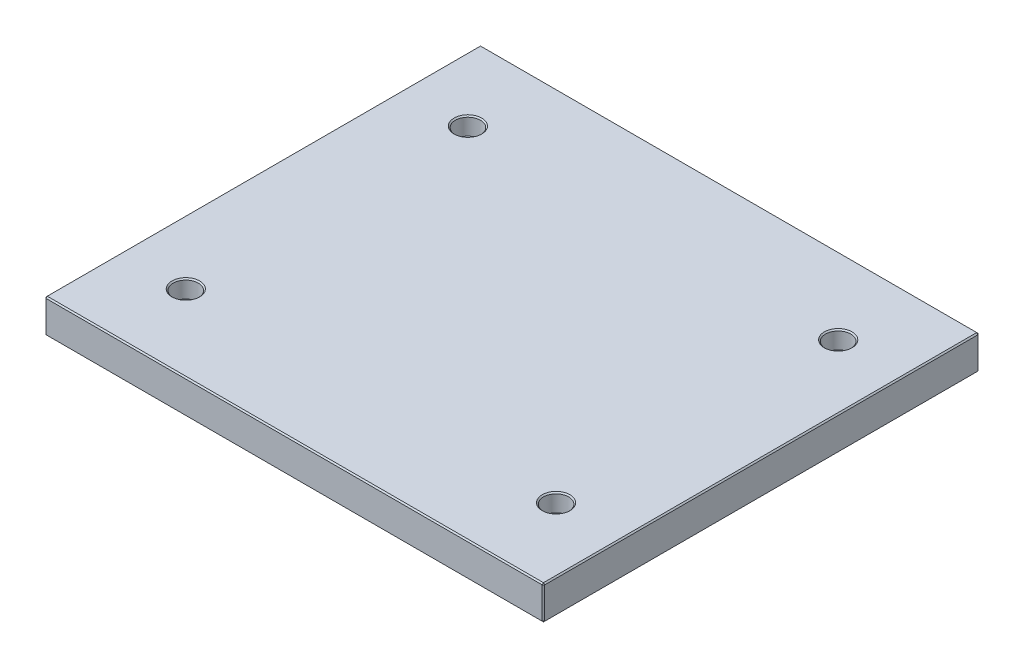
ISO-10303-21;
HEADER;
FILE_DESCRIPTION(('STEP AP214'),'2;1');
FILE_NAME('part.step','',(''),(''),'','','');
FILE_SCHEMA(('AUTOMOTIVE_DESIGN { 1 0 10303 214 1 1 1 1 }'));
ENDSEC;
DATA;
#1=APPLICATION_CONTEXT('core data for automotive mechanical design processes');
#2=APPLICATION_PROTOCOL_DEFINITION('international standard','automotive_design',2000,#1);
#3=PRODUCT_CONTEXT('',#1,'mechanical');
#4=PRODUCT('Part','Part','',(#3));
#5=PRODUCT_RELATED_PRODUCT_CATEGORY('part','',(#4));
#6=PRODUCT_DEFINITION_FORMATION('','',#4);
#7=PRODUCT_DEFINITION_CONTEXT('part definition',#1,'design');
#8=PRODUCT_DEFINITION('design','',#6,#7);
#9=PRODUCT_DEFINITION_SHAPE('','',#8);
#10=(LENGTH_UNIT() NAMED_UNIT(*) SI_UNIT(.MILLI.,.METRE.));
#11=(NAMED_UNIT(*) PLANE_ANGLE_UNIT() SI_UNIT($,.RADIAN.));
#12=(NAMED_UNIT(*) SI_UNIT($,.STERADIAN.) SOLID_ANGLE_UNIT());
#13=UNCERTAINTY_MEASURE_WITH_UNIT(LENGTH_MEASURE(1.E-05),#10,'distance_accuracy_value','');
#14=(GEOMETRIC_REPRESENTATION_CONTEXT(3) GLOBAL_UNCERTAINTY_ASSIGNED_CONTEXT((#13)) GLOBAL_UNIT_ASSIGNED_CONTEXT((#10,
#11,#12)) REPRESENTATION_CONTEXT('',''));
#15=CARTESIAN_POINT('',(0.,0.,0.));
#16=DIRECTION('',(0.,0.,1.));
#17=DIRECTION('',(1.,0.,0.));
#18=AXIS2_PLACEMENT_3D('',#15,#16,#17);
#19=CARTESIAN_POINT('',(-198.,27.,173.));
#20=DIRECTION('',(1.,0.,0.));
#21=DIRECTION('',(0.,0.,-1.));
#22=AXIS2_PLACEMENT_3D('',#19,#20,#21);
#23=PLANE('',#22);
#24=DIRECTION('',(0.,-1.,0.));
#25=VECTOR('',#24,1.);
#26=CARTESIAN_POINT('',(-198.,27.,-172.));
#27=LINE('',#26,#25);
#28=CARTESIAN_POINT('',(-198.,26.,-172.));
#29=VERTEX_POINT('',#28);
#30=CARTESIAN_POINT('',(-198.,1.,-172.));
#31=VERTEX_POINT('',#30);
#32=EDGE_CURVE('E115',#29,#31,#27,.T.);
#33=ORIENTED_EDGE('',*,*,#32,.T.);
#34=DIRECTION('',(0.,0.,1.));
#35=VECTOR('',#34,1.);
#36=CARTESIAN_POINT('',(-198.,1.,173.));
#37=LINE('',#36,#35);
#38=CARTESIAN_POINT('',(-198.,1.,172.));
#39=VERTEX_POINT('',#38);
#40=EDGE_CURVE('E111',#31,#39,#37,.T.);
#41=ORIENTED_EDGE('',*,*,#40,.T.);
#42=DIRECTION('',(0.,1.,0.));
#43=VECTOR('',#42,1.);
#44=CARTESIAN_POINT('',(-198.,27.,172.));
#45=LINE('',#44,#43);
#46=CARTESIAN_POINT('',(-198.,26.,172.));
#47=VERTEX_POINT('',#46);
#48=EDGE_CURVE('E104',#39,#47,#45,.T.);
#49=ORIENTED_EDGE('',*,*,#48,.T.);
#50=DIRECTION('',(0.,0.,-1.));
#51=VECTOR('',#50,1.);
#52=CARTESIAN_POINT('',(-198.,26.,-173.));
#53=LINE('',#52,#51);
#54=EDGE_CURVE('E108',#47,#29,#53,.T.);
#55=ORIENTED_EDGE('',*,*,#54,.T.);
#56=EDGE_LOOP('',(#33,#41,#49,#55));
#57=FACE_BOUND('',#56,.T.);
#58=ADVANCED_FACE('F16',(#57),#23,.F.);
#59=CARTESIAN_POINT('',(198.,27.,173.));
#60=DIRECTION('',(0.,0.,-1.));
#61=DIRECTION('',(-1.,0.,0.));
#62=AXIS2_PLACEMENT_3D('',#59,#60,#61);
#63=PLANE('',#62);
#64=DIRECTION('',(-1.,0.,0.));
#65=VECTOR('',#64,1.);
#66=CARTESIAN_POINT('',(-198.,26.,173.));
#67=LINE('',#66,#65);
#68=CARTESIAN_POINT('',(197.,26.,173.));
#69=VERTEX_POINT('',#68);
#70=CARTESIAN_POINT('',(-197.,26.,173.));
#71=VERTEX_POINT('',#70);
#72=EDGE_CURVE('E170',#69,#71,#67,.T.);
#73=ORIENTED_EDGE('',*,*,#72,.T.);
#74=DIRECTION('',(0.,-1.,0.));
#75=VECTOR('',#74,1.);
#76=CARTESIAN_POINT('',(-197.,27.,173.));
#77=LINE('',#76,#75);
#78=CARTESIAN_POINT('',(-197.,1.,173.));
#79=VERTEX_POINT('',#78);
#80=EDGE_CURVE('E123',#71,#79,#77,.T.);
#81=ORIENTED_EDGE('',*,*,#80,.T.);
#82=DIRECTION('',(1.,0.,0.));
#83=VECTOR('',#82,1.);
#84=CARTESIAN_POINT('',(198.,1.,173.));
#85=LINE('',#84,#83);
#86=CARTESIAN_POINT('',(197.,1.,173.));
#87=VERTEX_POINT('',#86);
#88=EDGE_CURVE('E174',#79,#87,#85,.T.);
#89=ORIENTED_EDGE('',*,*,#88,.T.);
#90=DIRECTION('',(0.,1.,0.));
#91=VECTOR('',#90,1.);
#92=CARTESIAN_POINT('',(197.,27.,173.));
#93=LINE('',#92,#91);
#94=EDGE_CURVE('E172',#87,#69,#93,.T.);
#95=ORIENTED_EDGE('',*,*,#94,.T.);
#96=EDGE_LOOP('',(#73,#81,#89,#95));
#97=FACE_BOUND('',#96,.T.);
#98=ADVANCED_FACE('F317',(#97),#63,.F.);
#99=CARTESIAN_POINT('',(198.,27.,173.));
#100=DIRECTION('',(-1.,0.,0.));
#101=DIRECTION('',(0.,0.,1.));
#102=AXIS2_PLACEMENT_3D('',#99,#100,#101);
#103=PLANE('',#102);
#104=DIRECTION('',(0.,0.,-1.));
#105=VECTOR('',#104,1.);
#106=CARTESIAN_POINT('',(198.,1.,173.));
#107=LINE('',#106,#105);
#108=CARTESIAN_POINT('',(198.,1.,172.));
#109=VERTEX_POINT('',#108);
#110=CARTESIAN_POINT('',(198.,1.,-172.));
#111=VERTEX_POINT('',#110);
#112=EDGE_CURVE('E165',#109,#111,#107,.T.);
#113=ORIENTED_EDGE('',*,*,#112,.T.);
#114=DIRECTION('',(0.,1.,0.));
#115=VECTOR('',#114,1.);
#116=CARTESIAN_POINT('',(198.,27.,-172.));
#117=LINE('',#116,#115);
#118=CARTESIAN_POINT('',(198.,26.,-172.));
#119=VERTEX_POINT('',#118);
#120=EDGE_CURVE('E167',#111,#119,#117,.T.);
#121=ORIENTED_EDGE('',*,*,#120,.T.);
#122=DIRECTION('',(0.,0.,1.));
#123=VECTOR('',#122,1.);
#124=CARTESIAN_POINT('',(198.,26.,173.));
#125=LINE('',#124,#123);
#126=CARTESIAN_POINT('',(198.,26.,172.));
#127=VERTEX_POINT('',#126);
#128=EDGE_CURVE('E161',#119,#127,#125,.T.);
#129=ORIENTED_EDGE('',*,*,#128,.T.);
#130=DIRECTION('',(0.,-1.,0.));
#131=VECTOR('',#130,1.);
#132=CARTESIAN_POINT('',(198.,27.,172.));
#133=LINE('',#132,#131);
#134=EDGE_CURVE('E163',#127,#109,#133,.T.);
#135=ORIENTED_EDGE('',*,*,#134,.T.);
#136=EDGE_LOOP('',(#113,#121,#129,#135));
#137=FACE_BOUND('',#136,.T.);
#138=ADVANCED_FACE('F323',(#137),#103,.F.);
#139=CARTESIAN_POINT('',(198.,27.,-173.));
#140=DIRECTION('',(0.,0.,1.));
#141=DIRECTION('',(1.,0.,0.));
#142=AXIS2_PLACEMENT_3D('',#139,#140,#141);
#143=PLANE('',#142);
#144=DIRECTION('',(0.,-1.,0.));
#145=VECTOR('',#144,1.);
#146=CARTESIAN_POINT('',(197.,27.,-173.));
#147=LINE('',#146,#145);
#148=CARTESIAN_POINT('',(197.,26.,-173.));
#149=VERTEX_POINT('',#148);
#150=CARTESIAN_POINT('',(197.,1.,-173.));
#151=VERTEX_POINT('',#150);
#152=EDGE_CURVE('E154',#149,#151,#147,.T.);
#153=ORIENTED_EDGE('',*,*,#152,.T.);
#154=DIRECTION('',(-1.,0.,0.));
#155=VECTOR('',#154,1.);
#156=CARTESIAN_POINT('',(198.,1.,-173.));
#157=LINE('',#156,#155);
#158=CARTESIAN_POINT('',(-197.,1.,-173.));
#159=VERTEX_POINT('',#158);
#160=EDGE_CURVE('E159',#151,#159,#157,.T.);
#161=ORIENTED_EDGE('',*,*,#160,.T.);
#162=DIRECTION('',(0.,1.,0.));
#163=VECTOR('',#162,1.);
#164=CARTESIAN_POINT('',(-197.,27.,-173.));
#165=LINE('',#164,#163);
#166=CARTESIAN_POINT('',(-197.,26.,-173.));
#167=VERTEX_POINT('',#166);
#168=EDGE_CURVE('E156',#159,#167,#165,.T.);
#169=ORIENTED_EDGE('',*,*,#168,.T.);
#170=DIRECTION('',(1.,0.,0.));
#171=VECTOR('',#170,1.);
#172=CARTESIAN_POINT('',(198.,26.,-173.));
#173=LINE('',#172,#171);
#174=EDGE_CURVE('E152',#167,#149,#173,.T.);
#175=ORIENTED_EDGE('',*,*,#174,.T.);
#176=EDGE_LOOP('',(#153,#161,#169,#175));
#177=FACE_BOUND('',#176,.T.);
#178=ADVANCED_FACE('F465',(#177),#143,.F.);
#179=CARTESIAN_POINT('',(0.,27.,0.));
#180=DIRECTION('',(0.,1.,0.));
#181=DIRECTION('',(0.,0.,1.));
#182=AXIS2_PLACEMENT_3D('',#179,#180,#181);
#183=PLANE('',#182);
#184=CARTESIAN_POINT('',(-147.,27.,112.));
#185=DIRECTION('',(0.,1.,0.));
#186=DIRECTION('',(0.,0.,1.));
#187=AXIS2_PLACEMENT_3D('',#184,#185,#186);
#188=CIRCLE('',#187,11.0000000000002);
#189=CARTESIAN_POINT('',(-147.,27.,123.));
#190=VERTEX_POINT('',#189);
#191=EDGE_CURVE('E290',#190,#190,#188,.F.);
#192=ORIENTED_EDGE('',*,*,#191,.T.);
#193=EDGE_LOOP('',(#192));
#194=FACE_BOUND('',#193,.T.);
#195=CARTESIAN_POINT('',(147.,27.,112.));
#196=DIRECTION('',(0.,1.,0.));
#197=DIRECTION('',(0.,0.,1.));
#198=AXIS2_PLACEMENT_3D('',#195,#196,#197);
#199=CIRCLE('',#198,11.0000000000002);
#200=CARTESIAN_POINT('',(147.,27.,123.));
#201=VERTEX_POINT('',#200);
#202=EDGE_CURVE('E287',#201,#201,#199,.F.);
#203=ORIENTED_EDGE('',*,*,#202,.T.);
#204=EDGE_LOOP('',(#203));
#205=FACE_BOUND('',#204,.T.);
#206=CARTESIAN_POINT('',(147.,27.,-112.));
#207=DIRECTION('',(0.,1.,0.));
#208=DIRECTION('',(0.,0.,1.));
#209=AXIS2_PLACEMENT_3D('',#206,#207,#208);
#210=CIRCLE('',#209,11.0000000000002);
#211=CARTESIAN_POINT('',(147.,27.,-101.));
#212=VERTEX_POINT('',#211);
#213=EDGE_CURVE('E284',#212,#212,#210,.F.);
#214=ORIENTED_EDGE('',*,*,#213,.T.);
#215=EDGE_LOOP('',(#214));
#216=FACE_BOUND('',#215,.T.);
#217=CARTESIAN_POINT('',(-147.,27.,-112.));
#218=DIRECTION('',(0.,1.,0.));
#219=DIRECTION('',(0.,0.,1.));
#220=AXIS2_PLACEMENT_3D('',#217,#218,#219);
#221=CIRCLE('',#220,11.0000000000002);
#222=CARTESIAN_POINT('',(-147.,27.,-101.));
#223=VERTEX_POINT('',#222);
#224=EDGE_CURVE('E281',#223,#223,#221,.F.);
#225=ORIENTED_EDGE('',*,*,#224,.T.);
#226=EDGE_LOOP('',(#225));
#227=FACE_BOUND('',#226,.T.);
#228=DIRECTION('',(0.,0.,-1.));
#229=VECTOR('',#228,1.);
#230=CARTESIAN_POINT('',(197.,27.,-173.));
#231=LINE('',#230,#229);
#232=CARTESIAN_POINT('',(197.,27.,172.));
#233=VERTEX_POINT('',#232);
#234=CARTESIAN_POINT('',(197.,27.,-172.));
#235=VERTEX_POINT('',#234);
#236=EDGE_CURVE('E31',#233,#235,#231,.T.);
#237=ORIENTED_EDGE('',*,*,#236,.T.);
#238=DIRECTION('',(-1.,0.,0.));
#239=VECTOR('',#238,1.);
#240=CARTESIAN_POINT('',(-198.,27.,-172.));
#241=LINE('',#240,#239);
#242=CARTESIAN_POINT('',(-197.,27.,-172.));
#243=VERTEX_POINT('',#242);
#244=EDGE_CURVE('E190',#235,#243,#241,.T.);
#245=ORIENTED_EDGE('',*,*,#244,.T.);
#246=DIRECTION('',(0.,0.,1.));
#247=VECTOR('',#246,1.);
#248=CARTESIAN_POINT('',(-197.,27.,173.));
#249=LINE('',#248,#247);
#250=CARTESIAN_POINT('',(-197.,27.,172.));
#251=VERTEX_POINT('',#250);
#252=EDGE_CURVE('E186',#243,#251,#249,.T.);
#253=ORIENTED_EDGE('',*,*,#252,.T.);
#254=DIRECTION('',(1.,0.,0.));
#255=VECTOR('',#254,1.);
#256=CARTESIAN_POINT('',(198.,27.,172.));
#257=LINE('',#256,#255);
#258=EDGE_CURVE('E36',#251,#233,#257,.T.);
#259=ORIENTED_EDGE('',*,*,#258,.T.);
#260=EDGE_LOOP('',(#237,#245,#253,#259));
#261=FACE_BOUND('',#260,.T.);
#262=ADVANCED_FACE('F462',(#194,#205,#216,#227,#261),#183,.T.);
#263=CARTESIAN_POINT('',(0.,0.,0.));
#264=DIRECTION('',(0.,1.,0.));
#265=DIRECTION('',(0.,0.,1.));
#266=AXIS2_PLACEMENT_3D('',#263,#264,#265);
#267=PLANE('',#266);
#268=CARTESIAN_POINT('',(147.,0.,-112.));
#269=DIRECTION('',(0.,1.,0.));
#270=DIRECTION('',(0.,0.,1.));
#271=AXIS2_PLACEMENT_3D('',#268,#269,#270);
#272=CIRCLE('',#271,8.00000000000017);
#273=CARTESIAN_POINT('',(147.,0.,-104.));
#274=VERTEX_POINT('',#273);
#275=EDGE_CURVE('E263',#274,#274,#272,.T.);
#276=ORIENTED_EDGE('',*,*,#275,.T.);
#277=EDGE_LOOP('',(#276));
#278=FACE_BOUND('',#277,.T.);
#279=CARTESIAN_POINT('',(147.,0.,112.));
#280=DIRECTION('',(0.,1.,0.));
#281=DIRECTION('',(0.,0.,1.));
#282=AXIS2_PLACEMENT_3D('',#279,#280,#281);
#283=CIRCLE('',#282,8.00000000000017);
#284=CARTESIAN_POINT('',(147.,0.,120.));
#285=VERTEX_POINT('',#284);
#286=EDGE_CURVE('E260',#285,#285,#283,.T.);
#287=ORIENTED_EDGE('',*,*,#286,.T.);
#288=EDGE_LOOP('',(#287));
#289=FACE_BOUND('',#288,.T.);
#290=CARTESIAN_POINT('',(-147.,0.,112.));
#291=DIRECTION('',(0.,1.,0.));
#292=DIRECTION('',(0.,0.,1.));
#293=AXIS2_PLACEMENT_3D('',#290,#291,#292);
#294=CIRCLE('',#293,8.);
#295=CARTESIAN_POINT('',(-147.,0.,120.));
#296=VERTEX_POINT('',#295);
#297=EDGE_CURVE('E257',#296,#296,#294,.T.);
#298=ORIENTED_EDGE('',*,*,#297,.T.);
#299=EDGE_LOOP('',(#298));
#300=FACE_BOUND('',#299,.T.);
#301=CARTESIAN_POINT('',(-147.,0.,-112.));
#302=DIRECTION('',(0.,1.,0.));
#303=DIRECTION('',(0.,0.,1.));
#304=AXIS2_PLACEMENT_3D('',#301,#302,#303);
#305=CIRCLE('',#304,8.);
#306=CARTESIAN_POINT('',(-147.,0.,-104.));
#307=VERTEX_POINT('',#306);
#308=EDGE_CURVE('E192',#307,#307,#305,.T.);
#309=ORIENTED_EDGE('',*,*,#308,.T.);
#310=EDGE_LOOP('',(#309));
#311=FACE_BOUND('',#310,.T.);
#312=DIRECTION('',(0.,0.,1.));
#313=VECTOR('',#312,1.);
#314=CARTESIAN_POINT('',(197.,0.,0.));
#315=LINE('',#314,#313);
#316=CARTESIAN_POINT('',(197.,0.,-172.));
#317=VERTEX_POINT('',#316);
#318=CARTESIAN_POINT('',(197.,0.,172.));
#319=VERTEX_POINT('',#318);
#320=EDGE_CURVE('E177',#317,#319,#315,.T.);
#321=ORIENTED_EDGE('',*,*,#320,.T.);
#322=DIRECTION('',(-1.,0.,0.));
#323=VECTOR('',#322,1.);
#324=CARTESIAN_POINT('',(0.,0.,172.));
#325=LINE('',#324,#323);
#326=CARTESIAN_POINT('',(-197.,0.,172.));
#327=VERTEX_POINT('',#326);
#328=EDGE_CURVE('E183',#319,#327,#325,.T.);
#329=ORIENTED_EDGE('',*,*,#328,.T.);
#330=DIRECTION('',(0.,0.,-1.));
#331=VECTOR('',#330,1.);
#332=CARTESIAN_POINT('',(-197.,0.,0.));
#333=LINE('',#332,#331);
#334=CARTESIAN_POINT('',(-197.,0.,-172.));
#335=VERTEX_POINT('',#334);
#336=EDGE_CURVE('E181',#327,#335,#333,.T.);
#337=ORIENTED_EDGE('',*,*,#336,.T.);
#338=DIRECTION('',(1.,0.,0.));
#339=VECTOR('',#338,1.);
#340=CARTESIAN_POINT('',(0.,0.,-172.));
#341=LINE('',#340,#339);
#342=EDGE_CURVE('E179',#335,#317,#341,.T.);
#343=ORIENTED_EDGE('',*,*,#342,.T.);
#344=EDGE_LOOP('',(#321,#329,#337,#343));
#345=FACE_BOUND('',#344,.T.);
#346=ADVANCED_FACE('F402',(#278,#289,#300,#311,#345),#267,.F.);
#347=CARTESIAN_POINT('',(198.,27.,172.));
#348=DIRECTION('',(-0.707106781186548,0.,-0.707106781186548));
#349=DIRECTION('',(0.,-1.,0.));
#350=AXIS2_PLACEMENT_3D('',#347,#348,#349);
#351=PLANE('',#350);
#352=DIRECTION('',(-0.707106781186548,0.,0.707106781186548));
#353=VECTOR('',#352,1.);
#354=CARTESIAN_POINT('',(197.,26.,173.));
#355=LINE('',#354,#353);
#356=EDGE_CURVE('E141',#69,#127,#355,.F.);
#357=ORIENTED_EDGE('',*,*,#356,.F.);
#358=ORIENTED_EDGE('',*,*,#94,.F.);
#359=DIRECTION('',(0.707106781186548,0.,-0.707106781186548));
#360=VECTOR('',#359,1.);
#361=CARTESIAN_POINT('',(197.,1.,173.));
#362=LINE('',#361,#360);
#363=EDGE_CURVE('E144',#109,#87,#362,.F.);
#364=ORIENTED_EDGE('',*,*,#363,.F.);
#365=ORIENTED_EDGE('',*,*,#134,.F.);
#366=EDGE_LOOP('',(#357,#358,#364,#365));
#367=FACE_BOUND('',#366,.T.);
#368=ADVANCED_FACE('F398',(#367),#351,.F.);
#369=CARTESIAN_POINT('',(197.,26.,173.));
#370=DIRECTION('',(0.577350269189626,0.577350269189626,0.577350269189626));
#371=DIRECTION('',(0.707106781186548,0.,-0.707106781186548));
#372=AXIS2_PLACEMENT_3D('',#369,#370,#371);
#373=PLANE('',#372);
#374=DIRECTION('',(0.,-0.707106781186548,0.707106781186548));
#375=VECTOR('',#374,1.);
#376=CARTESIAN_POINT('',(197.,26.,173.));
#377=LINE('',#376,#375);
#378=EDGE_CURVE('E235',#69,#233,#377,.F.);
#379=ORIENTED_EDGE('',*,*,#378,.F.);
#380=ORIENTED_EDGE('',*,*,#356,.T.);
#381=DIRECTION('',(-0.707106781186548,0.707106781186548,0.));
#382=VECTOR('',#381,1.);
#383=CARTESIAN_POINT('',(197.5,26.5,172.));
#384=LINE('',#383,#382);
#385=EDGE_CURVE('E237',#233,#127,#384,.F.);
#386=ORIENTED_EDGE('',*,*,#385,.F.);
#387=EDGE_LOOP('',(#379,#380,#386));
#388=FACE_BOUND('',#387,.T.);
#389=ADVANCED_FACE('F394',(#388),#373,.T.);
#390=CARTESIAN_POINT('',(197.,1.,173.));
#391=DIRECTION('',(0.577350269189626,-0.577350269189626,0.577350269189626));
#392=DIRECTION('',(0.707106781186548,0.,-0.707106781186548));
#393=AXIS2_PLACEMENT_3D('',#390,#391,#392);
#394=PLANE('',#393);
#395=DIRECTION('',(-0.707106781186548,-0.707106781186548,0.));
#396=VECTOR('',#395,1.);
#397=CARTESIAN_POINT('',(197.5,0.5,172.));
#398=LINE('',#397,#396);
#399=EDGE_CURVE('E229',#109,#319,#398,.T.);
#400=ORIENTED_EDGE('',*,*,#399,.F.);
#401=ORIENTED_EDGE('',*,*,#363,.T.);
#402=DIRECTION('',(0.,0.707106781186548,0.707106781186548));
#403=VECTOR('',#402,1.);
#404=CARTESIAN_POINT('',(197.,1.,173.));
#405=LINE('',#404,#403);
#406=EDGE_CURVE('E232',#319,#87,#405,.T.);
#407=ORIENTED_EDGE('',*,*,#406,.F.);
#408=EDGE_LOOP('',(#400,#401,#407));
#409=FACE_BOUND('',#408,.T.);
#410=ADVANCED_FACE('F390',(#409),#394,.T.);
#411=CARTESIAN_POINT('',(197.,27.,0.));
#412=DIRECTION('',(0.707106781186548,0.707106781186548,0.));
#413=DIRECTION('',(0.,0.,1.));
#414=AXIS2_PLACEMENT_3D('',#411,#412,#413);
#415=PLANE('',#414);
#416=ORIENTED_EDGE('',*,*,#385,.T.);
#417=ORIENTED_EDGE('',*,*,#128,.F.);
#418=DIRECTION('',(0.707106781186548,-0.707106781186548,0.));
#419=VECTOR('',#418,1.);
#420=CARTESIAN_POINT('',(198.,26.,-172.));
#421=LINE('',#420,#419);
#422=EDGE_CURVE('E224',#235,#119,#421,.T.);
#423=ORIENTED_EDGE('',*,*,#422,.F.);
#424=ORIENTED_EDGE('',*,*,#236,.F.);
#425=EDGE_LOOP('',(#416,#417,#423,#424));
#426=FACE_BOUND('',#425,.T.);
#427=ADVANCED_FACE('F386',(#426),#415,.T.);
#428=CARTESIAN_POINT('',(0.,27.,172.));
#429=DIRECTION('',(0.,0.707106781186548,0.707106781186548));
#430=DIRECTION('',(-1.,0.,0.));
#431=AXIS2_PLACEMENT_3D('',#428,#429,#430);
#432=PLANE('',#431);
#433=ORIENTED_EDGE('',*,*,#378,.T.);
#434=ORIENTED_EDGE('',*,*,#258,.F.);
#435=DIRECTION('',(0.,0.707106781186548,-0.707106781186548));
#436=VECTOR('',#435,1.);
#437=CARTESIAN_POINT('',(-197.,26.5,172.5));
#438=LINE('',#437,#436);
#439=EDGE_CURVE('E127',#71,#251,#438,.T.);
#440=ORIENTED_EDGE('',*,*,#439,.F.);
#441=ORIENTED_EDGE('',*,*,#72,.F.);
#442=EDGE_LOOP('',(#433,#434,#440,#441));
#443=FACE_BOUND('',#442,.T.);
#444=ADVANCED_FACE('F383',(#443),#432,.T.);
#445=CARTESIAN_POINT('',(-197.,27.,173.));
#446=DIRECTION('',(0.707106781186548,0.,-0.707106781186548));
#447=DIRECTION('',(0.,-1.,0.));
#448=AXIS2_PLACEMENT_3D('',#445,#446,#447);
#449=PLANE('',#448);
#450=DIRECTION('',(0.707106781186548,0.,0.707106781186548));
#451=VECTOR('',#450,1.);
#452=CARTESIAN_POINT('',(-197.,1.,173.));
#453=LINE('',#452,#451);
#454=EDGE_CURVE('E128',#79,#39,#453,.F.);
#455=ORIENTED_EDGE('',*,*,#454,.F.);
#456=ORIENTED_EDGE('',*,*,#80,.F.);
#457=DIRECTION('',(-0.707106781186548,0.,-0.707106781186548));
#458=VECTOR('',#457,1.);
#459=CARTESIAN_POINT('',(-198.,26.,172.));
#460=LINE('',#459,#458);
#461=EDGE_CURVE('E119',#47,#71,#460,.F.);
#462=ORIENTED_EDGE('',*,*,#461,.F.);
#463=ORIENTED_EDGE('',*,*,#48,.F.);
#464=EDGE_LOOP('',(#455,#456,#462,#463));
#465=FACE_BOUND('',#464,.T.);
#466=ADVANCED_FACE('F121',(#465),#449,.F.);
#467=CARTESIAN_POINT('',(198.,1.,173.));
#468=DIRECTION('',(0.,0.707106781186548,-0.707106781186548));
#469=DIRECTION('',(1.,0.,0.));
#470=AXIS2_PLACEMENT_3D('',#467,#468,#469);
#471=PLANE('',#470);
#472=ORIENTED_EDGE('',*,*,#406,.T.);
#473=ORIENTED_EDGE('',*,*,#88,.F.);
#474=DIRECTION('',(0.,-0.707106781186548,-0.707106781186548));
#475=VECTOR('',#474,1.);
#476=CARTESIAN_POINT('',(-197.,1.,173.));
#477=LINE('',#476,#475);
#478=EDGE_CURVE('E220',#327,#79,#477,.F.);
#479=ORIENTED_EDGE('',*,*,#478,.F.);
#480=ORIENTED_EDGE('',*,*,#328,.F.);
#481=EDGE_LOOP('',(#472,#473,#479,#480));
#482=FACE_BOUND('',#481,.T.);
#483=ADVANCED_FACE('F376',(#482),#471,.F.);
#484=CARTESIAN_POINT('',(198.,1.,173.));
#485=DIRECTION('',(-0.707106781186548,0.707106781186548,0.));
#486=DIRECTION('',(0.,0.,-1.));
#487=AXIS2_PLACEMENT_3D('',#484,#485,#486);
#488=PLANE('',#487);
#489=ORIENTED_EDGE('',*,*,#399,.T.);
#490=ORIENTED_EDGE('',*,*,#320,.F.);
#491=DIRECTION('',(0.707106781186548,0.707106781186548,0.));
#492=VECTOR('',#491,1.);
#493=CARTESIAN_POINT('',(197.5,0.5,-172.));
#494=LINE('',#493,#492);
#495=EDGE_CURVE('E217',#111,#317,#494,.F.);
#496=ORIENTED_EDGE('',*,*,#495,.F.);
#497=ORIENTED_EDGE('',*,*,#112,.F.);
#498=EDGE_LOOP('',(#489,#490,#496,#497));
#499=FACE_BOUND('',#498,.T.);
#500=ADVANCED_FACE('F372',(#499),#488,.F.);
#501=CARTESIAN_POINT('',(197.,27.,-173.));
#502=DIRECTION('',(-0.707106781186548,0.,0.707106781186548));
#503=DIRECTION('',(0.,-1.,0.));
#504=AXIS2_PLACEMENT_3D('',#501,#502,#503);
#505=PLANE('',#504);
#506=DIRECTION('',(0.707106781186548,0.,0.707106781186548));
#507=VECTOR('',#506,1.);
#508=CARTESIAN_POINT('',(198.,26.,-172.));
#509=LINE('',#508,#507);
#510=EDGE_CURVE('E226',#119,#149,#509,.F.);
#511=ORIENTED_EDGE('',*,*,#510,.F.);
#512=ORIENTED_EDGE('',*,*,#120,.F.);
#513=DIRECTION('',(-0.707106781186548,0.,-0.707106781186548));
#514=VECTOR('',#513,1.);
#515=CARTESIAN_POINT('',(197.,1.,-173.));
#516=LINE('',#515,#514);
#517=EDGE_CURVE('E214',#151,#111,#516,.F.);
#518=ORIENTED_EDGE('',*,*,#517,.F.);
#519=ORIENTED_EDGE('',*,*,#152,.F.);
#520=EDGE_LOOP('',(#511,#512,#518,#519));
#521=FACE_BOUND('',#520,.T.);
#522=ADVANCED_FACE('F368',(#521),#505,.F.);
#523=CARTESIAN_POINT('',(198.,26.,-172.));
#524=DIRECTION('',(0.577350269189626,0.577350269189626,-0.577350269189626));
#525=DIRECTION('',(-0.707106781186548,0.,-0.707106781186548));
#526=AXIS2_PLACEMENT_3D('',#523,#524,#525);
#527=PLANE('',#526);
#528=ORIENTED_EDGE('',*,*,#422,.T.);
#529=ORIENTED_EDGE('',*,*,#510,.T.);
#530=DIRECTION('',(0.,0.707106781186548,0.707106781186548));
#531=VECTOR('',#530,1.);
#532=CARTESIAN_POINT('',(197.,26.5,-172.5));
#533=LINE('',#532,#531);
#534=EDGE_CURVE('E135',#235,#149,#533,.F.);
#535=ORIENTED_EDGE('',*,*,#534,.F.);
#536=EDGE_LOOP('',(#528,#529,#535));
#537=FACE_BOUND('',#536,.T.);
#538=ADVANCED_FACE('F365',(#537),#527,.T.);
#539=CARTESIAN_POINT('',(-198.,26.,172.));
#540=DIRECTION('',(-0.577350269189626,0.577350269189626,0.577350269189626));
#541=DIRECTION('',(0.707106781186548,0.,0.707106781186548));
#542=AXIS2_PLACEMENT_3D('',#539,#540,#541);
#543=PLANE('',#542);
#544=ORIENTED_EDGE('',*,*,#461,.T.);
#545=ORIENTED_EDGE('',*,*,#439,.T.);
#546=DIRECTION('',(-0.707106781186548,-0.707106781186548,0.));
#547=VECTOR('',#546,1.);
#548=CARTESIAN_POINT('',(-198.,26.,172.));
#549=LINE('',#548,#547);
#550=EDGE_CURVE('E131',#47,#251,#549,.F.);
#551=ORIENTED_EDGE('',*,*,#550,.F.);
#552=EDGE_LOOP('',(#544,#545,#551));
#553=FACE_BOUND('',#552,.T.);
#554=ADVANCED_FACE('F132',(#553),#543,.T.);
#555=CARTESIAN_POINT('',(-197.,1.,173.));
#556=DIRECTION('',(-0.577350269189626,-0.577350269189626,0.577350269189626));
#557=DIRECTION('',(0.707106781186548,0.,0.707106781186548));
#558=AXIS2_PLACEMENT_3D('',#555,#556,#557);
#559=PLANE('',#558);
#560=ORIENTED_EDGE('',*,*,#478,.T.);
#561=ORIENTED_EDGE('',*,*,#454,.T.);
#562=DIRECTION('',(-0.707106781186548,0.707106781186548,0.));
#563=VECTOR('',#562,1.);
#564=CARTESIAN_POINT('',(-197.5,0.5,172.));
#565=LINE('',#564,#563);
#566=EDGE_CURVE('E136',#327,#39,#565,.T.);
#567=ORIENTED_EDGE('',*,*,#566,.F.);
#568=EDGE_LOOP('',(#560,#561,#567));
#569=FACE_BOUND('',#568,.T.);
#570=ADVANCED_FACE('F358',(#569),#559,.T.);
#571=CARTESIAN_POINT('',(197.,1.,-173.));
#572=DIRECTION('',(0.577350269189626,-0.577350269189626,-0.577350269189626));
#573=DIRECTION('',(-0.707106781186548,0.,-0.707106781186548));
#574=AXIS2_PLACEMENT_3D('',#571,#572,#573);
#575=PLANE('',#574);
#576=ORIENTED_EDGE('',*,*,#517,.T.);
#577=ORIENTED_EDGE('',*,*,#495,.T.);
#578=DIRECTION('',(0.,-0.707106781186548,0.707106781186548));
#579=VECTOR('',#578,1.);
#580=CARTESIAN_POINT('',(197.,1.,-173.));
#581=LINE('',#580,#579);
#582=EDGE_CURVE('E207',#151,#317,#581,.T.);
#583=ORIENTED_EDGE('',*,*,#582,.F.);
#584=EDGE_LOOP('',(#576,#577,#583));
#585=FACE_BOUND('',#584,.T.);
#586=ADVANCED_FACE('F354',(#585),#575,.T.);
#587=CARTESIAN_POINT('',(0.,27.,-172.));
#588=DIRECTION('',(0.,0.707106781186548,-0.707106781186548));
#589=DIRECTION('',(1.,0.,0.));
#590=AXIS2_PLACEMENT_3D('',#587,#588,#589);
#591=PLANE('',#590);
#592=ORIENTED_EDGE('',*,*,#534,.T.);
#593=ORIENTED_EDGE('',*,*,#174,.F.);
#594=DIRECTION('',(0.,-0.707106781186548,-0.707106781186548));
#595=VECTOR('',#594,1.);
#596=CARTESIAN_POINT('',(-197.,26.,-173.));
#597=LINE('',#596,#595);
#598=EDGE_CURVE('E204',#243,#167,#597,.T.);
#599=ORIENTED_EDGE('',*,*,#598,.F.);
#600=ORIENTED_EDGE('',*,*,#244,.F.);
#601=EDGE_LOOP('',(#592,#593,#599,#600));
#602=FACE_BOUND('',#601,.T.);
#603=ADVANCED_FACE('F351',(#602),#591,.T.);
#604=CARTESIAN_POINT('',(-197.,27.,0.));
#605=DIRECTION('',(-0.707106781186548,0.707106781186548,0.));
#606=DIRECTION('',(0.,0.,-1.));
#607=AXIS2_PLACEMENT_3D('',#604,#605,#606);
#608=PLANE('',#607);
#609=ORIENTED_EDGE('',*,*,#550,.T.);
#610=ORIENTED_EDGE('',*,*,#252,.F.);
#611=DIRECTION('',(0.707106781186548,0.707106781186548,0.));
#612=VECTOR('',#611,1.);
#613=CARTESIAN_POINT('',(-197.5,26.5,-172.));
#614=LINE('',#613,#612);
#615=EDGE_CURVE('E139',#29,#243,#614,.T.);
#616=ORIENTED_EDGE('',*,*,#615,.F.);
#617=ORIENTED_EDGE('',*,*,#54,.F.);
#618=EDGE_LOOP('',(#609,#610,#616,#617));
#619=FACE_BOUND('',#618,.T.);
#620=ADVANCED_FACE('F138',(#619),#608,.T.);
#621=CARTESIAN_POINT('',(-198.,1.,173.));
#622=DIRECTION('',(0.707106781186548,0.707106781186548,0.));
#623=DIRECTION('',(0.,0.,1.));
#624=AXIS2_PLACEMENT_3D('',#621,#622,#623);
#625=PLANE('',#624);
#626=ORIENTED_EDGE('',*,*,#566,.T.);
#627=ORIENTED_EDGE('',*,*,#40,.F.);
#628=DIRECTION('',(0.707106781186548,-0.707106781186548,0.));
#629=VECTOR('',#628,1.);
#630=CARTESIAN_POINT('',(-198.,1.,-172.));
#631=LINE('',#630,#629);
#632=EDGE_CURVE('E200',#335,#31,#631,.F.);
#633=ORIENTED_EDGE('',*,*,#632,.F.);
#634=ORIENTED_EDGE('',*,*,#336,.F.);
#635=EDGE_LOOP('',(#626,#627,#633,#634));
#636=FACE_BOUND('',#635,.T.);
#637=ADVANCED_FACE('F344',(#636),#625,.F.);
#638=CARTESIAN_POINT('',(198.,1.,-173.));
#639=DIRECTION('',(0.,0.707106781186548,0.707106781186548));
#640=DIRECTION('',(-1.,0.,0.));
#641=AXIS2_PLACEMENT_3D('',#638,#639,#640);
#642=PLANE('',#641);
#643=ORIENTED_EDGE('',*,*,#582,.T.);
#644=ORIENTED_EDGE('',*,*,#342,.F.);
#645=DIRECTION('',(0.,0.707106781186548,-0.707106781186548));
#646=VECTOR('',#645,1.);
#647=CARTESIAN_POINT('',(-197.,0.5,-172.5));
#648=LINE('',#647,#646);
#649=EDGE_CURVE('E197',#159,#335,#648,.F.);
#650=ORIENTED_EDGE('',*,*,#649,.F.);
#651=ORIENTED_EDGE('',*,*,#160,.F.);
#652=EDGE_LOOP('',(#643,#644,#650,#651));
#653=FACE_BOUND('',#652,.T.);
#654=ADVANCED_FACE('F340',(#653),#642,.F.);
#655=CARTESIAN_POINT('',(-197.,26.,-173.));
#656=DIRECTION('',(-0.577350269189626,0.577350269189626,-0.577350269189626));
#657=DIRECTION('',(-0.707106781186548,0.,0.707106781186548));
#658=AXIS2_PLACEMENT_3D('',#655,#656,#657);
#659=PLANE('',#658);
#660=ORIENTED_EDGE('',*,*,#615,.T.);
#661=ORIENTED_EDGE('',*,*,#598,.T.);
#662=DIRECTION('',(0.707106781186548,0.,-0.707106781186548));
#663=VECTOR('',#662,1.);
#664=CARTESIAN_POINT('',(-197.,26.,-173.));
#665=LINE('',#664,#663);
#666=EDGE_CURVE('E195',#29,#167,#665,.T.);
#667=ORIENTED_EDGE('',*,*,#666,.F.);
#668=EDGE_LOOP('',(#660,#661,#667));
#669=FACE_BOUND('',#668,.T.);
#670=ADVANCED_FACE('F336',(#669),#659,.T.);
#671=CARTESIAN_POINT('',(-198.,1.,-172.));
#672=DIRECTION('',(-0.577350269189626,-0.577350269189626,-0.577350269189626));
#673=DIRECTION('',(-0.707106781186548,0.,0.707106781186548));
#674=AXIS2_PLACEMENT_3D('',#671,#672,#673);
#675=PLANE('',#674);
#676=ORIENTED_EDGE('',*,*,#649,.T.);
#677=ORIENTED_EDGE('',*,*,#632,.T.);
#678=DIRECTION('',(-0.707106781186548,0.,0.707106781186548));
#679=VECTOR('',#678,1.);
#680=CARTESIAN_POINT('',(-198.,1.,-172.));
#681=LINE('',#680,#679);
#682=EDGE_CURVE('E193',#159,#31,#681,.T.);
#683=ORIENTED_EDGE('',*,*,#682,.F.);
#684=EDGE_LOOP('',(#676,#677,#683));
#685=FACE_BOUND('',#684,.T.);
#686=ADVANCED_FACE('F332',(#685),#675,.T.);
#687=CARTESIAN_POINT('',(-198.,27.,-172.));
#688=DIRECTION('',(0.707106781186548,0.,0.707106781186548));
#689=DIRECTION('',(0.,-1.,0.));
#690=AXIS2_PLACEMENT_3D('',#687,#688,#689);
#691=PLANE('',#690);
#692=ORIENTED_EDGE('',*,*,#666,.T.);
#693=ORIENTED_EDGE('',*,*,#168,.F.);
#694=ORIENTED_EDGE('',*,*,#682,.T.);
#695=ORIENTED_EDGE('',*,*,#32,.F.);
#696=EDGE_LOOP('',(#692,#693,#694,#695));
#697=FACE_BOUND('',#696,.T.);
#698=ADVANCED_FACE('F328',(#697),#691,.F.);
#699=CARTESIAN_POINT('',(-147.,13.,-112.));
#700=DIRECTION('',(0.,1.,0.));
#701=DIRECTION('',(0.,0.,1.));
#702=AXIS2_PLACEMENT_3D('',#699,#700,#701);
#703=CYLINDRICAL_SURFACE('',#702,10.);
#704=CARTESIAN_POINT('',(-147.,26.,-112.));
#705=DIRECTION('',(0.,1.,0.));
#706=DIRECTION('',(0.,0.,1.));
#707=AXIS2_PLACEMENT_3D('',#704,#705,#706);
#708=CIRCLE('',#707,10.);
#709=CARTESIAN_POINT('',(-147.,26.,-102.));
#710=VERTEX_POINT('',#709);
#711=EDGE_CURVE('E10',#710,#710,#708,.T.);
#712=ORIENTED_EDGE('',*,*,#711,.T.);
#713=EDGE_LOOP('',(#712));
#714=FACE_BOUND('',#713,.T.);
#715=CARTESIAN_POINT('',(-147.,13.,-112.));
#716=DIRECTION('',(0.,1.,0.));
#717=DIRECTION('',(0.,0.,1.));
#718=AXIS2_PLACEMENT_3D('',#715,#716,#717);
#719=CIRCLE('',#718,10.);
#720=CARTESIAN_POINT('',(-147.,13.,-102.));
#721=VERTEX_POINT('',#720);
#722=EDGE_CURVE('E147',#721,#721,#719,.T.);
#723=ORIENTED_EDGE('',*,*,#722,.F.);
#724=EDGE_LOOP('',(#723));
#725=FACE_BOUND('',#724,.T.);
#726=ADVANCED_FACE('F331',(#714,#725),#703,.F.);
#727=CARTESIAN_POINT('',(-147.,13.,-112.));
#728=DIRECTION('',(0.,1.,0.));
#729=DIRECTION('',(0.,0.,1.));
#730=AXIS2_PLACEMENT_3D('',#727,#728,#729);
#731=PLANE('',#730);
#732=CARTESIAN_POINT('',(-147.,13.,-112.));
#733=DIRECTION('',(0.,1.,0.));
#734=DIRECTION('',(0.,0.,1.));
#735=AXIS2_PLACEMENT_3D('',#732,#733,#734);
#736=CIRCLE('',#735,7.);
#737=CARTESIAN_POINT('',(-147.,13.,-105.));
#738=VERTEX_POINT('',#737);
#739=EDGE_CURVE('E251',#738,#738,#736,.T.);
#740=ORIENTED_EDGE('',*,*,#739,.F.);
#741=EDGE_LOOP('',(#740));
#742=FACE_BOUND('',#741,.T.);
#743=ORIENTED_EDGE('',*,*,#722,.T.);
#744=EDGE_LOOP('',(#743));
#745=FACE_BOUND('',#744,.T.);
#746=ADVANCED_FACE('F450',(#742,#745),#731,.T.);
#747=CARTESIAN_POINT('',(147.,13.,-112.));
#748=DIRECTION('',(0.,1.,0.));
#749=DIRECTION('',(0.,0.,1.));
#750=AXIS2_PLACEMENT_3D('',#747,#748,#749);
#751=CYLINDRICAL_SURFACE('',#750,10.);
#752=CARTESIAN_POINT('',(147.,26.,-112.));
#753=DIRECTION('',(0.,1.,0.));
#754=DIRECTION('',(0.,0.,1.));
#755=AXIS2_PLACEMENT_3D('',#752,#753,#754);
#756=CIRCLE('',#755,10.);
#757=CARTESIAN_POINT('',(147.,26.,-102.));
#758=VERTEX_POINT('',#757);
#759=EDGE_CURVE('E24',#758,#758,#756,.T.);
#760=ORIENTED_EDGE('',*,*,#759,.T.);
#761=EDGE_LOOP('',(#760));
#762=FACE_BOUND('',#761,.T.);
#763=CARTESIAN_POINT('',(147.,13.,-112.));
#764=DIRECTION('',(0.,1.,0.));
#765=DIRECTION('',(0.,0.,1.));
#766=AXIS2_PLACEMENT_3D('',#763,#764,#765);
#767=CIRCLE('',#766,10.);
#768=CARTESIAN_POINT('',(147.,13.,-102.));
#769=VERTEX_POINT('',#768);
#770=EDGE_CURVE('E441',#769,#769,#767,.T.);
#771=ORIENTED_EDGE('',*,*,#770,.F.);
#772=EDGE_LOOP('',(#771));
#773=FACE_BOUND('',#772,.T.);
#774=ADVANCED_FACE('F298',(#762,#773),#751,.F.);
#775=CARTESIAN_POINT('',(147.,13.,-112.));
#776=DIRECTION('',(0.,1.,0.));
#777=DIRECTION('',(0.,0.,1.));
#778=AXIS2_PLACEMENT_3D('',#775,#776,#777);
#779=PLANE('',#778);
#780=CARTESIAN_POINT('',(147.,13.,-112.));
#781=DIRECTION('',(0.,1.,0.));
#782=DIRECTION('',(0.,0.,1.));
#783=AXIS2_PLACEMENT_3D('',#780,#781,#782);
#784=CIRCLE('',#783,7.);
#785=CARTESIAN_POINT('',(147.,13.,-105.));
#786=VERTEX_POINT('',#785);
#787=EDGE_CURVE('E248',#786,#786,#784,.T.);
#788=ORIENTED_EDGE('',*,*,#787,.F.);
#789=EDGE_LOOP('',(#788));
#790=FACE_BOUND('',#789,.T.);
#791=ORIENTED_EDGE('',*,*,#770,.T.);
#792=EDGE_LOOP('',(#791));
#793=FACE_BOUND('',#792,.T.);
#794=ADVANCED_FACE('F738',(#790,#793),#779,.T.);
#795=CARTESIAN_POINT('',(147.,13.,112.));
#796=DIRECTION('',(0.,1.,0.));
#797=DIRECTION('',(0.,0.,1.));
#798=AXIS2_PLACEMENT_3D('',#795,#796,#797);
#799=CYLINDRICAL_SURFACE('',#798,10.);
#800=CARTESIAN_POINT('',(147.,26.,112.));
#801=DIRECTION('',(0.,1.,0.));
#802=DIRECTION('',(0.,0.,1.));
#803=AXIS2_PLACEMENT_3D('',#800,#801,#802);
#804=CIRCLE('',#803,10.);
#805=CARTESIAN_POINT('',(147.,26.,122.));
#806=VERTEX_POINT('',#805);
#807=EDGE_CURVE('E293',#806,#806,#804,.T.);
#808=ORIENTED_EDGE('',*,*,#807,.T.);
#809=EDGE_LOOP('',(#808));
#810=FACE_BOUND('',#809,.T.);
#811=CARTESIAN_POINT('',(147.,13.,112.));
#812=DIRECTION('',(0.,1.,0.));
#813=DIRECTION('',(0.,0.,1.));
#814=AXIS2_PLACEMENT_3D('',#811,#812,#813);
#815=CIRCLE('',#814,10.);
#816=CARTESIAN_POINT('',(147.,13.,122.));
#817=VERTEX_POINT('',#816);
#818=EDGE_CURVE('E439',#817,#817,#815,.T.);
#819=ORIENTED_EDGE('',*,*,#818,.F.);
#820=EDGE_LOOP('',(#819));
#821=FACE_BOUND('',#820,.T.);
#822=ADVANCED_FACE('F730',(#810,#821),#799,.F.);
#823=CARTESIAN_POINT('',(147.,13.,112.));
#824=DIRECTION('',(0.,1.,0.));
#825=DIRECTION('',(0.,0.,1.));
#826=AXIS2_PLACEMENT_3D('',#823,#824,#825);
#827=PLANE('',#826);
#828=CARTESIAN_POINT('',(147.,13.,112.));
#829=DIRECTION('',(0.,1.,0.));
#830=DIRECTION('',(0.,0.,1.));
#831=AXIS2_PLACEMENT_3D('',#828,#829,#830);
#832=CIRCLE('',#831,7.);
#833=CARTESIAN_POINT('',(147.,13.,119.));
#834=VERTEX_POINT('',#833);
#835=EDGE_CURVE('E245',#834,#834,#832,.T.);
#836=ORIENTED_EDGE('',*,*,#835,.F.);
#837=EDGE_LOOP('',(#836));
#838=FACE_BOUND('',#837,.T.);
#839=ORIENTED_EDGE('',*,*,#818,.T.);
#840=EDGE_LOOP('',(#839));
#841=FACE_BOUND('',#840,.T.);
#842=ADVANCED_FACE('F434',(#838,#841),#827,.T.);
#843=CARTESIAN_POINT('',(-147.,13.,112.));
#844=DIRECTION('',(0.,1.,0.));
#845=DIRECTION('',(0.,0.,1.));
#846=AXIS2_PLACEMENT_3D('',#843,#844,#845);
#847=CYLINDRICAL_SURFACE('',#846,10.);
#848=CARTESIAN_POINT('',(-147.,26.,112.));
#849=DIRECTION('',(0.,1.,0.));
#850=DIRECTION('',(0.,0.,1.));
#851=AXIS2_PLACEMENT_3D('',#848,#849,#850);
#852=CIRCLE('',#851,10.);
#853=CARTESIAN_POINT('',(-147.,26.,122.));
#854=VERTEX_POINT('',#853);
#855=EDGE_CURVE('E278',#854,#854,#852,.T.);
#856=ORIENTED_EDGE('',*,*,#855,.T.);
#857=EDGE_LOOP('',(#856));
#858=FACE_BOUND('',#857,.T.);
#859=CARTESIAN_POINT('',(-147.,13.,112.));
#860=DIRECTION('',(0.,1.,0.));
#861=DIRECTION('',(0.,0.,1.));
#862=AXIS2_PLACEMENT_3D('',#859,#860,#861);
#863=CIRCLE('',#862,10.);
#864=CARTESIAN_POINT('',(-147.,13.,122.));
#865=VERTEX_POINT('',#864);
#866=EDGE_CURVE('E254',#865,#865,#863,.T.);
#867=ORIENTED_EDGE('',*,*,#866,.F.);
#868=EDGE_LOOP('',(#867));
#869=FACE_BOUND('',#868,.T.);
#870=ADVANCED_FACE('F430',(#858,#869),#847,.F.);
#871=CARTESIAN_POINT('',(-147.,13.,112.));
#872=DIRECTION('',(0.,1.,0.));
#873=DIRECTION('',(0.,0.,1.));
#874=AXIS2_PLACEMENT_3D('',#871,#872,#873);
#875=PLANE('',#874);
#876=CARTESIAN_POINT('',(-147.,13.,112.));
#877=DIRECTION('',(0.,1.,0.));
#878=DIRECTION('',(0.,0.,1.));
#879=AXIS2_PLACEMENT_3D('',#876,#877,#878);
#880=CIRCLE('',#879,7.);
#881=CARTESIAN_POINT('',(-147.,13.,119.));
#882=VERTEX_POINT('',#881);
#883=EDGE_CURVE('E242',#882,#882,#880,.T.);
#884=ORIENTED_EDGE('',*,*,#883,.F.);
#885=EDGE_LOOP('',(#884));
#886=FACE_BOUND('',#885,.T.);
#887=ORIENTED_EDGE('',*,*,#866,.T.);
#888=EDGE_LOOP('',(#887));
#889=FACE_BOUND('',#888,.T.);
#890=ADVANCED_FACE('F433',(#886,#889),#875,.T.);
#891=CARTESIAN_POINT('',(-147.,0.,112.));
#892=DIRECTION('',(0.,1.,0.));
#893=DIRECTION('',(0.,0.,1.));
#894=AXIS2_PLACEMENT_3D('',#891,#892,#893);
#895=CYLINDRICAL_SURFACE('',#894,7.);
#896=CARTESIAN_POINT('',(-147.,1.00000000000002,112.));
#897=DIRECTION('',(0.,1.,0.));
#898=DIRECTION('',(0.,0.,1.));
#899=AXIS2_PLACEMENT_3D('',#896,#897,#898);
#900=CIRCLE('',#899,7.);
#901=CARTESIAN_POINT('',(-147.,1.00000000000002,119.));
#902=VERTEX_POINT('',#901);
#903=EDGE_CURVE('E272',#902,#902,#900,.F.);
#904=ORIENTED_EDGE('',*,*,#903,.T.);
#905=EDGE_LOOP('',(#904));
#906=FACE_BOUND('',#905,.T.);
#907=ORIENTED_EDGE('',*,*,#883,.T.);
#908=EDGE_LOOP('',(#907));
#909=FACE_BOUND('',#908,.T.);
#910=ADVANCED_FACE('F705',(#906,#909),#895,.F.);
#911=CARTESIAN_POINT('',(147.,0.,112.));
#912=DIRECTION('',(0.,1.,0.));
#913=DIRECTION('',(0.,0.,1.));
#914=AXIS2_PLACEMENT_3D('',#911,#912,#913);
#915=CYLINDRICAL_SURFACE('',#914,7.);
#916=CARTESIAN_POINT('',(147.,1.00000000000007,112.));
#917=DIRECTION('',(0.,1.,0.));
#918=DIRECTION('',(0.,0.,1.));
#919=AXIS2_PLACEMENT_3D('',#916,#917,#918);
#920=CIRCLE('',#919,7.);
#921=CARTESIAN_POINT('',(147.,1.00000000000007,119.));
#922=VERTEX_POINT('',#921);
#923=EDGE_CURVE('E269',#922,#922,#920,.F.);
#924=ORIENTED_EDGE('',*,*,#923,.T.);
#925=EDGE_LOOP('',(#924));
#926=FACE_BOUND('',#925,.T.);
#927=ORIENTED_EDGE('',*,*,#835,.T.);
#928=EDGE_LOOP('',(#927));
#929=FACE_BOUND('',#928,.T.);
#930=ADVANCED_FACE('F697',(#926,#929),#915,.F.);
#931=CARTESIAN_POINT('',(147.,0.,-112.));
#932=DIRECTION('',(0.,1.,0.));
#933=DIRECTION('',(0.,0.,1.));
#934=AXIS2_PLACEMENT_3D('',#931,#932,#933);
#935=CYLINDRICAL_SURFACE('',#934,7.);
#936=CARTESIAN_POINT('',(147.,1.00000000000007,-112.));
#937=DIRECTION('',(0.,1.,0.));
#938=DIRECTION('',(0.,0.,1.));
#939=AXIS2_PLACEMENT_3D('',#936,#937,#938);
#940=CIRCLE('',#939,7.);
#941=CARTESIAN_POINT('',(147.,1.00000000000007,-105.));
#942=VERTEX_POINT('',#941);
#943=EDGE_CURVE('E266',#942,#942,#940,.F.);
#944=ORIENTED_EDGE('',*,*,#943,.T.);
#945=EDGE_LOOP('',(#944));
#946=FACE_BOUND('',#945,.T.);
#947=ORIENTED_EDGE('',*,*,#787,.T.);
#948=EDGE_LOOP('',(#947));
#949=FACE_BOUND('',#948,.T.);
#950=ADVANCED_FACE('F688',(#946,#949),#935,.F.);
#951=CARTESIAN_POINT('',(-147.,0.,-112.));
#952=DIRECTION('',(0.,1.,0.));
#953=DIRECTION('',(0.,0.,1.));
#954=AXIS2_PLACEMENT_3D('',#951,#952,#953);
#955=CYLINDRICAL_SURFACE('',#954,7.);
#956=CARTESIAN_POINT('',(-147.,1.00000000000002,-112.));
#957=DIRECTION('',(0.,1.,0.));
#958=DIRECTION('',(0.,0.,1.));
#959=AXIS2_PLACEMENT_3D('',#956,#957,#958);
#960=CIRCLE('',#959,7.);
#961=CARTESIAN_POINT('',(-147.,1.00000000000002,-105.));
#962=VERTEX_POINT('',#961);
#963=EDGE_CURVE('E275',#962,#962,#960,.F.);
#964=ORIENTED_EDGE('',*,*,#963,.T.);
#965=EDGE_LOOP('',(#964));
#966=FACE_BOUND('',#965,.T.);
#967=ORIENTED_EDGE('',*,*,#739,.T.);
#968=EDGE_LOOP('',(#967));
#969=FACE_BOUND('',#968,.T.);
#970=ADVANCED_FACE('F408',(#966,#969),#955,.F.);
#971=CARTESIAN_POINT('',(147.,0.,-112.));
#972=DIRECTION('',(0.,-1.,0.));
#973=DIRECTION('',(0.,0.,-1.));
#974=AXIS2_PLACEMENT_3D('',#971,#972,#973);
#975=CONICAL_SURFACE('',#974,8.00000000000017,0.785398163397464);
#976=ORIENTED_EDGE('',*,*,#943,.F.);
#977=EDGE_LOOP('',(#976));
#978=FACE_BOUND('',#977,.T.);
#979=ORIENTED_EDGE('',*,*,#275,.F.);
#980=EDGE_LOOP('',(#979));
#981=FACE_BOUND('',#980,.T.);
#982=ADVANCED_FACE('F404',(#978,#981),#975,.F.);
#983=CARTESIAN_POINT('',(147.,0.,112.));
#984=DIRECTION('',(0.,-1.,0.));
#985=DIRECTION('',(0.,0.,-1.));
#986=AXIS2_PLACEMENT_3D('',#983,#984,#985);
#987=CONICAL_SURFACE('',#986,8.00000000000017,0.785398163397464);
#988=ORIENTED_EDGE('',*,*,#923,.F.);
#989=EDGE_LOOP('',(#988));
#990=FACE_BOUND('',#989,.T.);
#991=ORIENTED_EDGE('',*,*,#286,.F.);
#992=EDGE_LOOP('',(#991));
#993=FACE_BOUND('',#992,.T.);
#994=ADVANCED_FACE('F407',(#990,#993),#987,.F.);
#995=CARTESIAN_POINT('',(-147.,0.,112.));
#996=DIRECTION('',(0.,-1.,0.));
#997=DIRECTION('',(0.,0.,-1.));
#998=AXIS2_PLACEMENT_3D('',#995,#996,#997);
#999=CONICAL_SURFACE('',#998,8.,0.785398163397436);
#1000=ORIENTED_EDGE('',*,*,#903,.F.);
#1001=EDGE_LOOP('',(#1000));
#1002=FACE_BOUND('',#1001,.T.);
#1003=ORIENTED_EDGE('',*,*,#297,.F.);
#1004=EDGE_LOOP('',(#1003));
#1005=FACE_BOUND('',#1004,.T.);
#1006=ADVANCED_FACE('F412',(#1002,#1005),#999,.F.);
#1007=CARTESIAN_POINT('',(-147.,0.,-112.));
#1008=DIRECTION('',(0.,-1.,0.));
#1009=DIRECTION('',(0.,0.,-1.));
#1010=AXIS2_PLACEMENT_3D('',#1007,#1008,#1009);
#1011=CONICAL_SURFACE('',#1010,8.,0.785398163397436);
#1012=ORIENTED_EDGE('',*,*,#963,.F.);
#1013=EDGE_LOOP('',(#1012));
#1014=FACE_BOUND('',#1013,.T.);
#1015=ORIENTED_EDGE('',*,*,#308,.F.);
#1016=EDGE_LOOP('',(#1015));
#1017=FACE_BOUND('',#1016,.T.);
#1018=ADVANCED_FACE('F416',(#1014,#1017),#1011,.F.);
#1019=CARTESIAN_POINT('',(-147.,26.,112.));
#1020=DIRECTION('',(0.,1.,0.));
#1021=DIRECTION('',(0.,0.,1.));
#1022=AXIS2_PLACEMENT_3D('',#1019,#1020,#1021);
#1023=CONICAL_SURFACE('',#1022,10.,0.785398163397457);
#1024=ORIENTED_EDGE('',*,*,#191,.F.);
#1025=EDGE_LOOP('',(#1024));
#1026=FACE_BOUND('',#1025,.T.);
#1027=ORIENTED_EDGE('',*,*,#855,.F.);
#1028=EDGE_LOOP('',(#1027));
#1029=FACE_BOUND('',#1028,.T.);
#1030=ADVANCED_FACE('F312',(#1026,#1029),#1023,.F.);
#1031=CARTESIAN_POINT('',(147.,26.,112.));
#1032=DIRECTION('',(0.,1.,0.));
#1033=DIRECTION('',(0.,0.,1.));
#1034=AXIS2_PLACEMENT_3D('',#1031,#1032,#1033);
#1035=CONICAL_SURFACE('',#1034,10.,0.785398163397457);
#1036=ORIENTED_EDGE('',*,*,#202,.F.);
#1037=EDGE_LOOP('',(#1036));
#1038=FACE_BOUND('',#1037,.T.);
#1039=ORIENTED_EDGE('',*,*,#807,.F.);
#1040=EDGE_LOOP('',(#1039));
#1041=FACE_BOUND('',#1040,.T.);
#1042=ADVANCED_FACE('F303',(#1038,#1041),#1035,.F.);
#1043=CARTESIAN_POINT('',(147.,26.,-112.));
#1044=DIRECTION('',(0.,1.,0.));
#1045=DIRECTION('',(0.,0.,1.));
#1046=AXIS2_PLACEMENT_3D('',#1043,#1044,#1045);
#1047=CONICAL_SURFACE('',#1046,10.,0.785398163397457);
#1048=ORIENTED_EDGE('',*,*,#213,.F.);
#1049=EDGE_LOOP('',(#1048));
#1050=FACE_BOUND('',#1049,.T.);
#1051=ORIENTED_EDGE('',*,*,#759,.F.);
#1052=EDGE_LOOP('',(#1051));
#1053=FACE_BOUND('',#1052,.T.);
#1054=ADVANCED_FACE('F301',(#1050,#1053),#1047,.F.);
#1055=CARTESIAN_POINT('',(-147.,26.,-112.));
#1056=DIRECTION('',(0.,1.,0.));
#1057=DIRECTION('',(0.,0.,1.));
#1058=AXIS2_PLACEMENT_3D('',#1055,#1056,#1057);
#1059=CONICAL_SURFACE('',#1058,10.,0.785398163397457);
#1060=ORIENTED_EDGE('',*,*,#224,.F.);
#1061=EDGE_LOOP('',(#1060));
#1062=FACE_BOUND('',#1061,.T.);
#1063=ORIENTED_EDGE('',*,*,#711,.F.);
#1064=EDGE_LOOP('',(#1063));
#1065=FACE_BOUND('',#1064,.T.);
#1066=ADVANCED_FACE('F18',(#1062,#1065),#1059,.F.);
#1067=CLOSED_SHELL('',(#58,#98,#138,#178,#262,#346,#368,#389,#410,#427,#444,#466,#483,#500,#522,
#538,#554,#570,#586,#603,#620,#637,#654,#670,#686,#698,#726,#746,#774,#794,#822,#842,#870,#890,
#910,#930,#950,#970,#982,#994,#1006,#1018,#1030,#1042,#1054,#1066));
#1068=MANIFOLD_SOLID_BREP('B1',#1067);
#1069=ADVANCED_BREP_SHAPE_REPRESENTATION('',(#18,#1068),#14);
#1070=SHAPE_DEFINITION_REPRESENTATION(#9,#1069);
ENDSEC;
END-ISO-10303-21;
